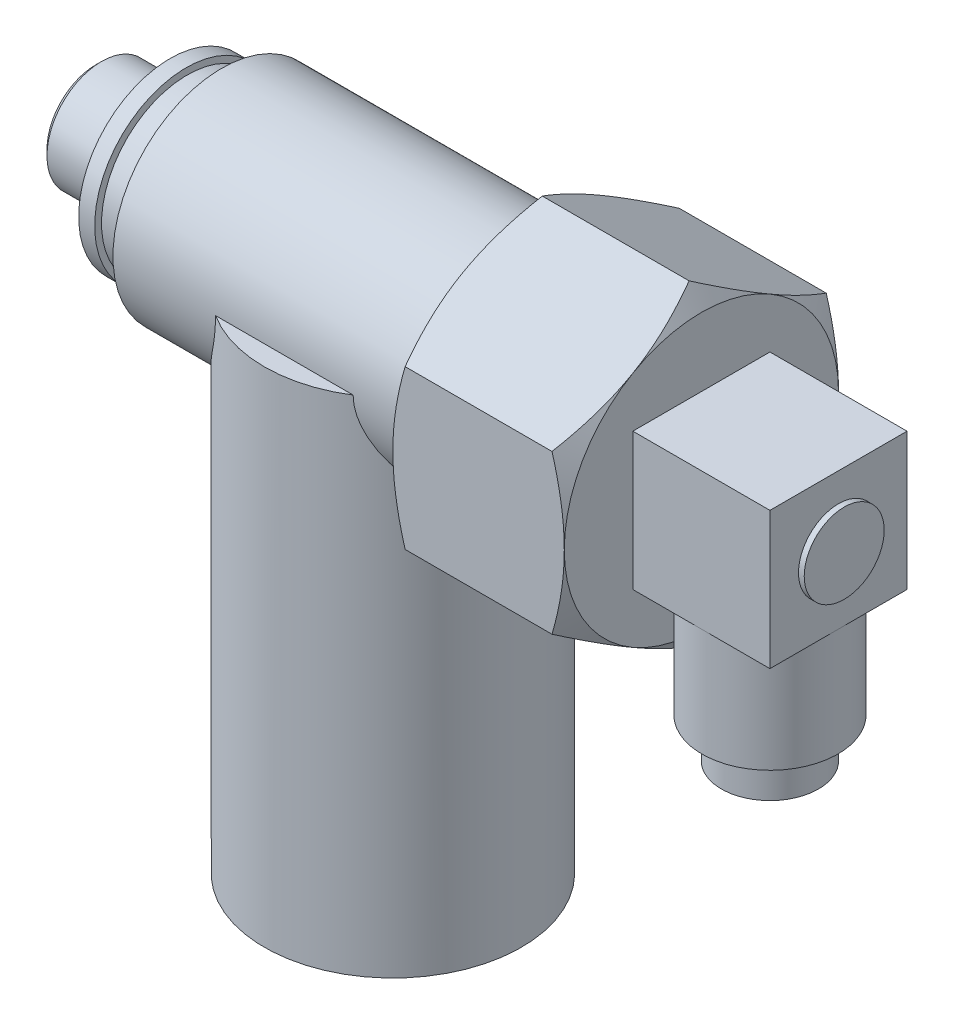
from build123d import *

# Parameters (mm, degrees)
EXTRUSION1_DEPTH = 15
ESQUISSE4_W      = 12
ESQUISSE4_H      = 12
EXTRUSION2_DEPTH = 6
CHANFREIN1_SIZE  = 0.5
ESQUISSE9_R      = 3.5
EXTRUSION3_DEPTH = 0.5


with BuildPart() as part:
    # Esquisse1 → R_volution1 (revolve)
    with BuildSketch(Plane.XY, mode=Mode.PRIVATE) as r_volution1_sk:
        Polygon((0, 0), (0, 4.775), (6.5, 4.775), (6.5, 8), (7.9, 8), (7.9, 4.775), (8, 4.775), (8, 7.5), (11, 7.5), (11, 9.5), (38, 9.5), (38, 0), align=None)
    revolve(r_volution1_sk.sketch.rotate(Axis((0, 0, 0), (-1, 0, 0)), 90), axis=Axis((0, 0, 0), (-1, 0, 0)))

    # Esquisse2 → Extrusion1 (add)
    with BuildSketch(Plane(origin=(38, 0, 0), x_dir=(0, 0, -1), z_dir=(1, 0, 0))):
        Polygon((12, 6.92820323), (0, 13.856406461), (-12, 6.92820323), (-12, -6.92820323), (0, -13.856406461), (12, -6.92820323), align=None)
    extrude(amount=EXTRUSION1_DEPTH)

    # Esquisse3 → Enl_vement de mati_re-R_volution1 (revolve, cut)
    with BuildSketch(Plane.XY):
        Polygon((53, 13.856406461), (53, 12), (51.92820323, 13.856406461), align=None)
        Polygon((38, 13.856406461), (39.07179677, 13.856406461), (38, 12), align=None)
    revolve(axis=Axis((0, 0, 0), (1, 0, 0)), mode=Mode.SUBTRACT)

    # Esquisse4 → Extrusion2 (add, symmetric)
    with BuildSketch(Plane.XY):
        with Locations((59, 0)):
            Rectangle(ESQUISSE4_W, ESQUISSE4_H)
    extrude(amount=EXTRUSION2_DEPTH, both=True)

    # Esquisse7 → R_volution6 (revolve)
    with BuildSketch(Plane.XY, mode=Mode.PRIVATE) as r_volution6_sk:
        Polygon((59, -6), (64.95, -6), (64.95, -15.5), (62, -15.5), (62, -16.5), (63.25, -16.5), (63.25, -19), (61, -19), (61, -9), (59, -9), align=None)
    revolve(r_volution6_sk.sketch.rotate(Axis((59, -6, 0), (0, 1, 0)), 90), axis=Axis((59, -6, 0), (0, 1, 0)))

    # Esquisse8 → R_volution7 (revolve)
    with BuildSketch(Plane.XY, mode=Mode.PRIVATE) as r_volution7_sk:
        Polygon((26, 0), (26, -37), (29, -37), (29, -47), (32, -47), (32, -45), (30, -45), (30, -44), (37.25, -44), (37.25, 0), align=None)
    revolve(r_volution7_sk.sketch.rotate(Axis((26, -17.316950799, 0), (0, 1, 0)), 90), axis=Axis((26, -17.316950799, 0), (0, 1, 0)))

    # Chanfrein1
    chanfrein1_edges = [part.edges().sort_by_distance(p)[0] for p in [
        (0, 0, 4.775),
    ]]
    chamfer(chanfrein1_edges, length=CHANFREIN1_SIZE)

    # Esquisse9 → Extrusion3 (add)
    with BuildSketch(Plane(origin=(65, 0, 0), x_dir=(0, 0, -1), z_dir=(1, 0, 0))):
        with Locations(Location((0, 0, 0), (0, 0, 180))):
            Circle(ESQUISSE9_R)
    extrude(amount=EXTRUSION3_DEPTH)


solid = part.part
